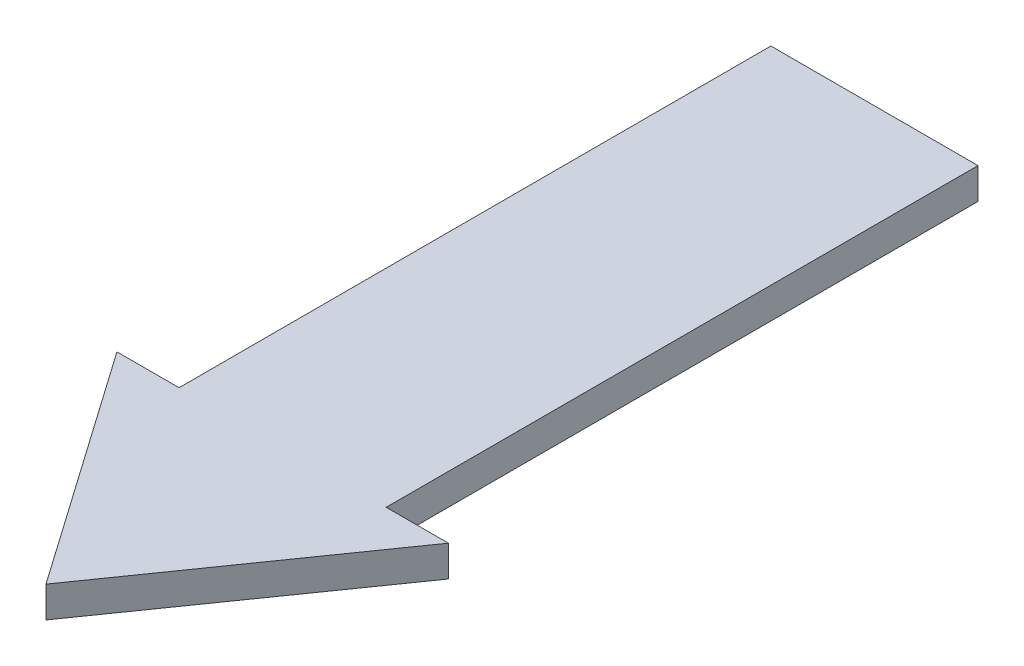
ISO-10303-21;
HEADER;
FILE_DESCRIPTION(('STEP AP214'),'2;1');
FILE_NAME('part.step','',(''),(''),'','','');
FILE_SCHEMA(('AUTOMOTIVE_DESIGN { 1 0 10303 214 1 1 1 1 }'));
ENDSEC;
DATA;
#1=APPLICATION_CONTEXT('core data for automotive mechanical design processes');
#2=APPLICATION_PROTOCOL_DEFINITION('international standard','automotive_design',2000,#1);
#3=PRODUCT_CONTEXT('',#1,'mechanical');
#4=PRODUCT('Part','Part','',(#3));
#5=PRODUCT_RELATED_PRODUCT_CATEGORY('part','',(#4));
#6=PRODUCT_DEFINITION_FORMATION('','',#4);
#7=PRODUCT_DEFINITION_CONTEXT('part definition',#1,'design');
#8=PRODUCT_DEFINITION('design','',#6,#7);
#9=PRODUCT_DEFINITION_SHAPE('','',#8);
#10=(LENGTH_UNIT() NAMED_UNIT(*) SI_UNIT(.MILLI.,.METRE.));
#11=(NAMED_UNIT(*) PLANE_ANGLE_UNIT() SI_UNIT($,.RADIAN.));
#12=(NAMED_UNIT(*) SI_UNIT($,.STERADIAN.) SOLID_ANGLE_UNIT());
#13=UNCERTAINTY_MEASURE_WITH_UNIT(LENGTH_MEASURE(1.E-05),#10,'distance_accuracy_value','');
#14=(GEOMETRIC_REPRESENTATION_CONTEXT(3) GLOBAL_UNCERTAINTY_ASSIGNED_CONTEXT((#13)) GLOBAL_UNIT_ASSIGNED_CONTEXT((#10,
#11,#12)) REPRESENTATION_CONTEXT('',''));
#15=CARTESIAN_POINT('',(0.,0.,0.));
#16=DIRECTION('',(0.,0.,1.));
#17=DIRECTION('',(1.,0.,0.));
#18=AXIS2_PLACEMENT_3D('',#15,#16,#17);
#19=CARTESIAN_POINT('',(-79.9999999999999,15.,-114.25184053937));
#20=DIRECTION('',(0.819152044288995,0.,-0.573576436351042));
#21=DIRECTION('',(-0.573576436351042,0.,-0.819152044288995));
#22=AXIS2_PLACEMENT_3D('',#19,#20,#21);
#23=PLANE('',#22);
#24=DIRECTION('',(0.573576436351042,0.,0.819152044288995));
#25=VECTOR('',#24,1.);
#26=CARTESIAN_POINT('',(-79.9999999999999,0.,-114.25184053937));
#27=LINE('',#26,#25);
#28=CARTESIAN_POINT('',(-79.9999999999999,0.,-114.25184053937));
#29=VERTEX_POINT('',#28);
#30=CARTESIAN_POINT('',(0.,0.,0.));
#31=VERTEX_POINT('',#30);
#32=EDGE_CURVE('E143',#29,#31,#27,.T.);
#33=ORIENTED_EDGE('',*,*,#32,.T.);
#34=DIRECTION('',(0.,-1.,0.));
#35=VECTOR('',#34,1.);
#36=CARTESIAN_POINT('',(0.,15.,0.));
#37=LINE('',#36,#35);
#38=CARTESIAN_POINT('',(0.,15.,0.));
#39=VERTEX_POINT('',#38);
#40=EDGE_CURVE('E136',#39,#31,#37,.T.);
#41=ORIENTED_EDGE('',*,*,#40,.F.);
#42=DIRECTION('',(0.573576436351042,0.,0.819152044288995));
#43=VECTOR('',#42,1.);
#44=CARTESIAN_POINT('',(-79.9999999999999,15.,-114.25184053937));
#45=LINE('',#44,#43);
#46=CARTESIAN_POINT('',(-79.9999999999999,15.,-114.25184053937));
#47=VERTEX_POINT('',#46);
#48=EDGE_CURVE('E86',#47,#39,#45,.T.);
#49=ORIENTED_EDGE('',*,*,#48,.F.);
#50=DIRECTION('',(0.,-1.,0.));
#51=VECTOR('',#50,1.);
#52=CARTESIAN_POINT('',(-79.9999999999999,15.,-114.25184053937));
#53=LINE('',#52,#51);
#54=EDGE_CURVE('E155',#47,#29,#53,.T.);
#55=ORIENTED_EDGE('',*,*,#54,.T.);
#56=EDGE_LOOP('',(#33,#41,#49,#55));
#57=FACE_BOUND('',#56,.T.);
#58=ADVANCED_FACE('F44',(#57),#23,.F.);
#59=CARTESIAN_POINT('',(0.,15.,-400.));
#60=DIRECTION('',(0.,0.,1.));
#61=DIRECTION('',(1.,0.,0.));
#62=AXIS2_PLACEMENT_3D('',#59,#60,#61);
#63=PLANE('',#62);
#64=DIRECTION('',(-1.,0.,0.));
#65=VECTOR('',#64,1.);
#66=CARTESIAN_POINT('',(0.,0.,-400.));
#67=LINE('',#66,#65);
#68=CARTESIAN_POINT('',(50.,0.,-400.));
#69=VERTEX_POINT('',#68);
#70=CARTESIAN_POINT('',(-50.,0.,-400.));
#71=VERTEX_POINT('',#70);
#72=EDGE_CURVE('E158',#69,#71,#67,.T.);
#73=ORIENTED_EDGE('',*,*,#72,.T.);
#74=DIRECTION('',(0.,-1.,0.));
#75=VECTOR('',#74,1.);
#76=CARTESIAN_POINT('',(-50.,15.,-400.));
#77=LINE('',#76,#75);
#78=CARTESIAN_POINT('',(-50.,15.,-400.));
#79=VERTEX_POINT('',#78);
#80=EDGE_CURVE('E11',#79,#71,#77,.T.);
#81=ORIENTED_EDGE('',*,*,#80,.F.);
#82=DIRECTION('',(-1.,0.,0.));
#83=VECTOR('',#82,1.);
#84=CARTESIAN_POINT('',(0.,15.,-400.));
#85=LINE('',#84,#83);
#86=CARTESIAN_POINT('',(50.,15.,-400.));
#87=VERTEX_POINT('',#86);
#88=EDGE_CURVE('E112',#87,#79,#85,.T.);
#89=ORIENTED_EDGE('',*,*,#88,.F.);
#90=DIRECTION('',(0.,-1.,0.));
#91=VECTOR('',#90,1.);
#92=CARTESIAN_POINT('',(50.,15.,-400.));
#93=LINE('',#92,#91);
#94=EDGE_CURVE('E116',#87,#69,#93,.T.);
#95=ORIENTED_EDGE('',*,*,#94,.T.);
#96=EDGE_LOOP('',(#73,#81,#89,#95));
#97=FACE_BOUND('',#96,.T.);
#98=ADVANCED_FACE('F114',(#97),#63,.F.);
#99=CARTESIAN_POINT('',(-50.,15.,-400.));
#100=DIRECTION('',(1.,0.,0.));
#101=DIRECTION('',(0.,0.,-1.));
#102=AXIS2_PLACEMENT_3D('',#99,#100,#101);
#103=PLANE('',#102);
#104=DIRECTION('',(0.,0.,1.));
#105=VECTOR('',#104,1.);
#106=CARTESIAN_POINT('',(-50.,0.,-400.));
#107=LINE('',#106,#105);
#108=CARTESIAN_POINT('',(-50.,0.,-114.25184053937));
#109=VERTEX_POINT('',#108);
#110=EDGE_CURVE('E75',#71,#109,#107,.T.);
#111=ORIENTED_EDGE('',*,*,#110,.T.);
#112=DIRECTION('',(0.,-1.,0.));
#113=VECTOR('',#112,1.);
#114=CARTESIAN_POINT('',(-50.,15.,-114.25184053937));
#115=LINE('',#114,#113);
#116=CARTESIAN_POINT('',(-50.,15.,-114.25184053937));
#117=VERTEX_POINT('',#116);
#118=EDGE_CURVE('E53',#117,#109,#115,.T.);
#119=ORIENTED_EDGE('',*,*,#118,.F.);
#120=DIRECTION('',(0.,0.,1.));
#121=VECTOR('',#120,1.);
#122=CARTESIAN_POINT('',(-50.,15.,-400.));
#123=LINE('',#122,#121);
#124=EDGE_CURVE('E119',#79,#117,#123,.T.);
#125=ORIENTED_EDGE('',*,*,#124,.F.);
#126=ORIENTED_EDGE('',*,*,#80,.T.);
#127=EDGE_LOOP('',(#111,#119,#125,#126));
#128=FACE_BOUND('',#127,.T.);
#129=ADVANCED_FACE('F193',(#128),#103,.F.);
#130=CARTESIAN_POINT('',(-50.,15.,-114.25184053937));
#131=DIRECTION('',(0.,0.,1.));
#132=DIRECTION('',(1.,0.,0.));
#133=AXIS2_PLACEMENT_3D('',#130,#131,#132);
#134=PLANE('',#133);
#135=DIRECTION('',(-1.,0.,0.));
#136=VECTOR('',#135,1.);
#137=CARTESIAN_POINT('',(-50.,0.,-114.25184053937));
#138=LINE('',#137,#136);
#139=EDGE_CURVE('E81',#109,#29,#138,.T.);
#140=ORIENTED_EDGE('',*,*,#139,.T.);
#141=ORIENTED_EDGE('',*,*,#54,.F.);
#142=DIRECTION('',(-1.,0.,0.));
#143=VECTOR('',#142,1.);
#144=CARTESIAN_POINT('',(-50.,15.,-114.25184053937));
#145=LINE('',#144,#143);
#146=EDGE_CURVE('E61',#117,#47,#145,.T.);
#147=ORIENTED_EDGE('',*,*,#146,.F.);
#148=ORIENTED_EDGE('',*,*,#118,.T.);
#149=EDGE_LOOP('',(#140,#141,#147,#148));
#150=FACE_BOUND('',#149,.T.);
#151=ADVANCED_FACE('F167',(#150),#134,.F.);
#152=CARTESIAN_POINT('',(0.,15.,0.));
#153=DIRECTION('',(0.,-1.,0.));
#154=DIRECTION('',(0.,0.,-1.));
#155=AXIS2_PLACEMENT_3D('',#152,#153,#154);
#156=PLANE('',#155);
#157=ORIENTED_EDGE('',*,*,#48,.T.);
#158=DIRECTION('',(-0.573576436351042,0.,0.819152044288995));
#159=VECTOR('',#158,1.);
#160=CARTESIAN_POINT('',(79.9999999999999,15.,-114.25184053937));
#161=LINE('',#160,#159);
#162=CARTESIAN_POINT('',(79.9999999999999,15.,-114.25184053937));
#163=VERTEX_POINT('',#162);
#164=EDGE_CURVE('E129',#163,#39,#161,.T.);
#165=ORIENTED_EDGE('',*,*,#164,.F.);
#166=DIRECTION('',(1.,0.,0.));
#167=VECTOR('',#166,1.);
#168=CARTESIAN_POINT('',(50.,15.,-114.25184053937));
#169=LINE('',#168,#167);
#170=CARTESIAN_POINT('',(50.,15.,-114.25184053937));
#171=VERTEX_POINT('',#170);
#172=EDGE_CURVE('E124',#171,#163,#169,.T.);
#173=ORIENTED_EDGE('',*,*,#172,.F.);
#174=DIRECTION('',(0.,0.,1.));
#175=VECTOR('',#174,1.);
#176=CARTESIAN_POINT('',(50.,15.,-400.));
#177=LINE('',#176,#175);
#178=EDGE_CURVE('E122',#87,#171,#177,.T.);
#179=ORIENTED_EDGE('',*,*,#178,.F.);
#180=ORIENTED_EDGE('',*,*,#88,.T.);
#181=ORIENTED_EDGE('',*,*,#124,.T.);
#182=ORIENTED_EDGE('',*,*,#146,.T.);
#183=EDGE_LOOP('',(#157,#165,#173,#179,#180,#181,#182));
#184=FACE_BOUND('',#183,.T.);
#185=ADVANCED_FACE('F123',(#184),#156,.F.);
#186=CARTESIAN_POINT('',(0.,0.,0.));
#187=DIRECTION('',(0.,-1.,0.));
#188=DIRECTION('',(0.,0.,-1.));
#189=AXIS2_PLACEMENT_3D('',#186,#187,#188);
#190=PLANE('',#189);
#191=ORIENTED_EDGE('',*,*,#32,.F.);
#192=ORIENTED_EDGE('',*,*,#139,.F.);
#193=ORIENTED_EDGE('',*,*,#110,.F.);
#194=ORIENTED_EDGE('',*,*,#72,.F.);
#195=DIRECTION('',(0.,0.,1.));
#196=VECTOR('',#195,1.);
#197=CARTESIAN_POINT('',(50.,0.,-400.));
#198=LINE('',#197,#196);
#199=CARTESIAN_POINT('',(50.,0.,-114.25184053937));
#200=VERTEX_POINT('',#199);
#201=EDGE_CURVE('E134',#69,#200,#198,.T.);
#202=ORIENTED_EDGE('',*,*,#201,.T.);
#203=DIRECTION('',(1.,0.,0.));
#204=VECTOR('',#203,1.);
#205=CARTESIAN_POINT('',(50.,0.,-114.25184053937));
#206=LINE('',#205,#204);
#207=CARTESIAN_POINT('',(79.9999999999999,0.,-114.25184053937));
#208=VERTEX_POINT('',#207);
#209=EDGE_CURVE('E181',#200,#208,#206,.T.);
#210=ORIENTED_EDGE('',*,*,#209,.T.);
#211=DIRECTION('',(-0.573576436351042,0.,0.819152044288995));
#212=VECTOR('',#211,1.);
#213=CARTESIAN_POINT('',(79.9999999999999,0.,-114.25184053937));
#214=LINE('',#213,#212);
#215=EDGE_CURVE('E173',#208,#31,#214,.T.);
#216=ORIENTED_EDGE('',*,*,#215,.T.);
#217=EDGE_LOOP('',(#191,#192,#193,#194,#202,#210,#216));
#218=FACE_BOUND('',#217,.T.);
#219=ADVANCED_FACE('F170',(#218),#190,.T.);
#220=CARTESIAN_POINT('',(79.9999999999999,15.,-114.25184053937));
#221=DIRECTION('',(-0.819152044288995,0.,-0.573576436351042));
#222=DIRECTION('',(0.573576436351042,0.,-0.819152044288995));
#223=AXIS2_PLACEMENT_3D('',#220,#221,#222);
#224=PLANE('',#223);
#225=ORIENTED_EDGE('',*,*,#215,.F.);
#226=DIRECTION('',(0.,-1.,0.));
#227=VECTOR('',#226,1.);
#228=CARTESIAN_POINT('',(79.9999999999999,15.,-114.25184053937));
#229=LINE('',#228,#227);
#230=EDGE_CURVE('E146',#163,#208,#229,.T.);
#231=ORIENTED_EDGE('',*,*,#230,.F.);
#232=ORIENTED_EDGE('',*,*,#164,.T.);
#233=ORIENTED_EDGE('',*,*,#40,.T.);
#234=EDGE_LOOP('',(#225,#231,#232,#233));
#235=FACE_BOUND('',#234,.T.);
#236=ADVANCED_FACE('F177',(#235),#224,.F.);
#237=CARTESIAN_POINT('',(50.,15.,-400.));
#238=DIRECTION('',(-1.,0.,0.));
#239=DIRECTION('',(0.,0.,-1.));
#240=AXIS2_PLACEMENT_3D('',#237,#238,#239);
#241=PLANE('',#240);
#242=ORIENTED_EDGE('',*,*,#201,.F.);
#243=ORIENTED_EDGE('',*,*,#94,.F.);
#244=ORIENTED_EDGE('',*,*,#178,.T.);
#245=DIRECTION('',(0.,-1.,0.));
#246=VECTOR('',#245,1.);
#247=CARTESIAN_POINT('',(50.,15.,-114.25184053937));
#248=LINE('',#247,#246);
#249=EDGE_CURVE('E137',#171,#200,#248,.T.);
#250=ORIENTED_EDGE('',*,*,#249,.T.);
#251=EDGE_LOOP('',(#242,#243,#244,#250));
#252=FACE_BOUND('',#251,.T.);
#253=ADVANCED_FACE('F132',(#252),#241,.F.);
#254=CARTESIAN_POINT('',(50.,15.,-114.25184053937));
#255=DIRECTION('',(0.,0.,1.));
#256=DIRECTION('',(-1.,0.,0.));
#257=AXIS2_PLACEMENT_3D('',#254,#255,#256);
#258=PLANE('',#257);
#259=ORIENTED_EDGE('',*,*,#209,.F.);
#260=ORIENTED_EDGE('',*,*,#249,.F.);
#261=ORIENTED_EDGE('',*,*,#172,.T.);
#262=ORIENTED_EDGE('',*,*,#230,.T.);
#263=EDGE_LOOP('',(#259,#260,#261,#262));
#264=FACE_BOUND('',#263,.T.);
#265=ADVANCED_FACE('F192',(#264),#258,.F.);
#266=CLOSED_SHELL('',(#58,#98,#129,#151,#185,#219,#236,#253,#265));
#267=MANIFOLD_SOLID_BREP('B2',#266);
#268=ADVANCED_BREP_SHAPE_REPRESENTATION('',(#18,#267),#14);
#269=SHAPE_DEFINITION_REPRESENTATION(#9,#268);
ENDSEC;
END-ISO-10303-21;
